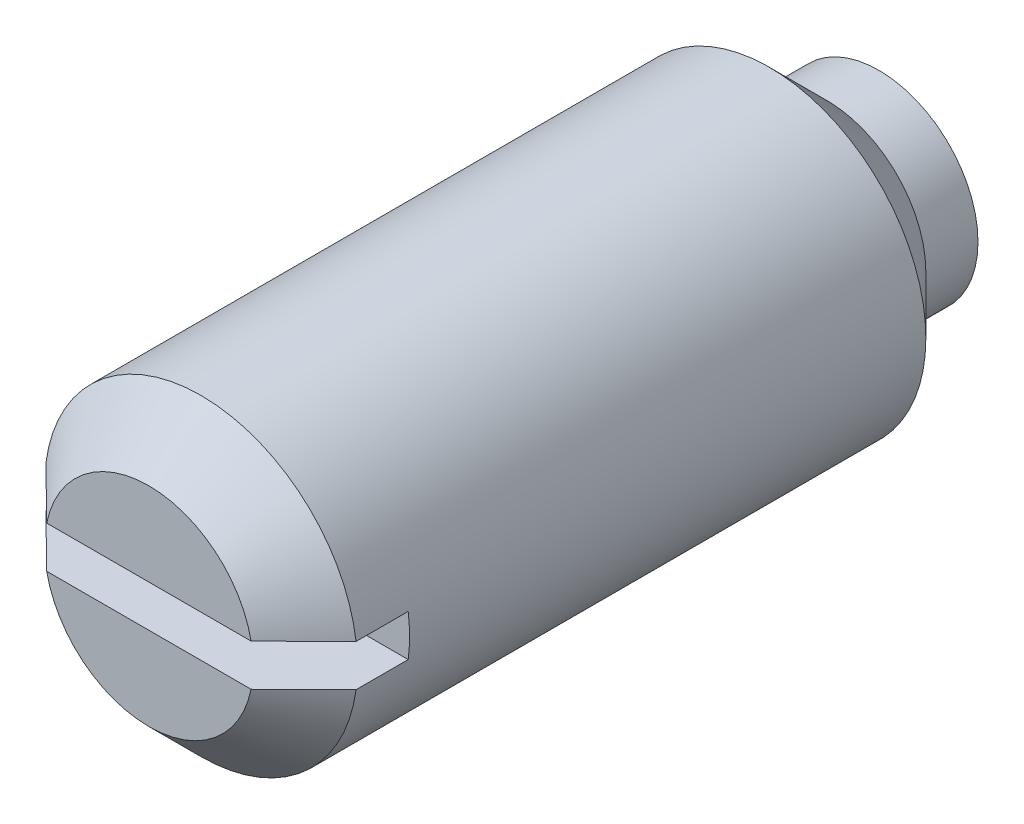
ISO-10303-21;
HEADER;
FILE_DESCRIPTION(('STEP AP214'),'2;1');
FILE_NAME('part.step','',(''),(''),'','','');
FILE_SCHEMA(('AUTOMOTIVE_DESIGN { 1 0 10303 214 1 1 1 1 }'));
ENDSEC;
DATA;
#1=APPLICATION_CONTEXT('core data for automotive mechanical design processes');
#2=APPLICATION_PROTOCOL_DEFINITION('international standard','automotive_design',2000,#1);
#3=PRODUCT_CONTEXT('',#1,'mechanical');
#4=PRODUCT('Part','Part','',(#3));
#5=PRODUCT_RELATED_PRODUCT_CATEGORY('part','',(#4));
#6=PRODUCT_DEFINITION_FORMATION('','',#4);
#7=PRODUCT_DEFINITION_CONTEXT('part definition',#1,'design');
#8=PRODUCT_DEFINITION('design','',#6,#7);
#9=PRODUCT_DEFINITION_SHAPE('','',#8);
#10=(LENGTH_UNIT() NAMED_UNIT(*) SI_UNIT(.MILLI.,.METRE.));
#11=(NAMED_UNIT(*) PLANE_ANGLE_UNIT() SI_UNIT($,.RADIAN.));
#12=(NAMED_UNIT(*) SI_UNIT($,.STERADIAN.) SOLID_ANGLE_UNIT());
#13=UNCERTAINTY_MEASURE_WITH_UNIT(LENGTH_MEASURE(1.E-05),#10,'distance_accuracy_value','');
#14=(GEOMETRIC_REPRESENTATION_CONTEXT(3) GLOBAL_UNCERTAINTY_ASSIGNED_CONTEXT((#13)) GLOBAL_UNIT_ASSIGNED_CONTEXT((#10,
#11,#12)) REPRESENTATION_CONTEXT('',''));
#15=CARTESIAN_POINT('',(0.,0.,0.));
#16=DIRECTION('',(0.,0.,1.));
#17=DIRECTION('',(1.,0.,0.));
#18=AXIS2_PLACEMENT_3D('',#15,#16,#17);
#19=CARTESIAN_POINT('',(0.,0.,-12.5));
#20=DIRECTION('',(0.,0.,-1.));
#21=DIRECTION('',(-1.,0.,0.));
#22=AXIS2_PLACEMENT_3D('',#19,#20,#21);
#23=CYLINDRICAL_SURFACE('',#22,1.5);
#24=DIRECTION('',(0.,0.,1.));
#25=VECTOR('',#24,1.);
#26=CARTESIAN_POINT('',(1.48660687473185,-0.2,6.5));
#27=LINE('',#26,#25);
#28=CARTESIAN_POINT('',(1.48660687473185,-0.2,6.5));
#29=VERTEX_POINT('',#28);
#30=CARTESIAN_POINT('',(1.48660687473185,-0.2,7.));
#31=VERTEX_POINT('',#30);
#32=EDGE_CURVE('E83',#29,#31,#27,.T.);
#33=ORIENTED_EDGE('',*,*,#32,.T.);
#34=CARTESIAN_POINT('',(0.,0.,7.));
#35=DIRECTION('',(0.,0.,1.));
#36=DIRECTION('',(1.,0.,0.));
#37=AXIS2_PLACEMENT_3D('',#34,#35,#36);
#38=CIRCLE('',#37,1.5);
#39=CARTESIAN_POINT('',(-1.48660687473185,-0.2,7.));
#40=VERTEX_POINT('',#39);
#41=EDGE_CURVE('E89',#31,#40,#38,.F.);
#42=ORIENTED_EDGE('',*,*,#41,.T.);
#43=DIRECTION('',(0.,0.,1.));
#44=VECTOR('',#43,1.);
#45=CARTESIAN_POINT('',(-1.48660687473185,-0.2,6.5));
#46=LINE('',#45,#44);
#47=CARTESIAN_POINT('',(-1.48660687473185,-0.2,6.5));
#48=VERTEX_POINT('',#47);
#49=EDGE_CURVE('E81',#48,#40,#46,.T.);
#50=ORIENTED_EDGE('',*,*,#49,.F.);
#51=CARTESIAN_POINT('',(0.,0.,6.5));
#52=DIRECTION('',(0.,0.,1.));
#53=DIRECTION('',(1.,0.,0.));
#54=AXIS2_PLACEMENT_3D('',#51,#52,#53);
#55=CIRCLE('',#54,1.5);
#56=CARTESIAN_POINT('',(-1.48660687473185,0.2,6.5));
#57=VERTEX_POINT('',#56);
#58=EDGE_CURVE('E65',#57,#48,#55,.T.);
#59=ORIENTED_EDGE('',*,*,#58,.F.);
#60=DIRECTION('',(0.,0.,1.));
#61=VECTOR('',#60,1.);
#62=CARTESIAN_POINT('',(-1.48660687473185,0.2,6.5));
#63=LINE('',#62,#61);
#64=CARTESIAN_POINT('',(-1.48660687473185,0.2,7.));
#65=VERTEX_POINT('',#64);
#66=EDGE_CURVE('E96',#57,#65,#63,.T.);
#67=ORIENTED_EDGE('',*,*,#66,.T.);
#68=CARTESIAN_POINT('',(0.,0.,7.));
#69=DIRECTION('',(0.,0.,1.));
#70=DIRECTION('',(1.,0.,0.));
#71=AXIS2_PLACEMENT_3D('',#68,#69,#70);
#72=CIRCLE('',#71,1.5);
#73=CARTESIAN_POINT('',(1.48660687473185,0.2,7.));
#74=VERTEX_POINT('',#73);
#75=EDGE_CURVE('E101',#65,#74,#72,.F.);
#76=ORIENTED_EDGE('',*,*,#75,.T.);
#77=DIRECTION('',(0.,0.,1.));
#78=VECTOR('',#77,1.);
#79=CARTESIAN_POINT('',(1.48660687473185,0.2,6.5));
#80=LINE('',#79,#78);
#81=CARTESIAN_POINT('',(1.48660687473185,0.2,6.5));
#82=VERTEX_POINT('',#81);
#83=EDGE_CURVE('E91',#82,#74,#80,.T.);
#84=ORIENTED_EDGE('',*,*,#83,.F.);
#85=EDGE_CURVE('E77',#29,#82,#55,.T.);
#86=ORIENTED_EDGE('',*,*,#85,.F.);
#87=EDGE_LOOP('',(#33,#42,#50,#59,#67,#76,#84,#86));
#88=FACE_BOUND('',#87,.T.);
#89=CARTESIAN_POINT('',(0.,0.,1.55));
#90=DIRECTION('',(0.,0.,1.));
#91=DIRECTION('',(1.,0.,0.));
#92=AXIS2_PLACEMENT_3D('',#89,#90,#91);
#93=CIRCLE('',#92,1.5);
#94=CARTESIAN_POINT('',(1.5,0.,1.55));
#95=VERTEX_POINT('',#94);
#96=EDGE_CURVE('E165',#95,#95,#93,.T.);
#97=ORIENTED_EDGE('',*,*,#96,.T.);
#98=EDGE_LOOP('',(#97));
#99=FACE_BOUND('',#98,.T.);
#100=ADVANCED_FACE('F14',(#88,#99),#23,.T.);
#101=CARTESIAN_POINT('',(0.,1.5,7.5));
#102=DIRECTION('',(0.,0.,1.));
#103=DIRECTION('',(1.,0.,0.));
#104=AXIS2_PLACEMENT_3D('',#101,#102,#103);
#105=PLANE('',#104);
#106=DIRECTION('',(1.,0.,0.));
#107=VECTOR('',#106,1.);
#108=CARTESIAN_POINT('',(-1.48660687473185,0.2,7.5));
#109=LINE('',#108,#107);
#110=CARTESIAN_POINT('',(-0.979795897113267,0.2,7.5));
#111=VERTEX_POINT('',#110);
#112=CARTESIAN_POINT('',(0.979795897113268,0.2,7.5));
#113=VERTEX_POINT('',#112);
#114=EDGE_CURVE('E75',#111,#113,#109,.T.);
#115=ORIENTED_EDGE('',*,*,#114,.T.);
#116=CARTESIAN_POINT('',(0.,0.,7.5));
#117=DIRECTION('',(0.,0.,1.));
#118=DIRECTION('',(1.,0.,0.));
#119=AXIS2_PLACEMENT_3D('',#116,#117,#118);
#120=CIRCLE('',#119,1.);
#121=EDGE_CURVE('E9',#113,#111,#120,.T.);
#122=ORIENTED_EDGE('',*,*,#121,.T.);
#123=EDGE_LOOP('',(#115,#122));
#124=FACE_BOUND('',#123,.T.);
#125=ADVANCED_FACE('F182',(#124),#105,.T.);
#126=DIRECTION('',(1.,0.,0.));
#127=VECTOR('',#126,1.);
#128=CARTESIAN_POINT('',(-1.48660687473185,-0.2,7.5));
#129=LINE('',#128,#127);
#130=CARTESIAN_POINT('',(-0.979795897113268,-0.2,7.5));
#131=VERTEX_POINT('',#130);
#132=CARTESIAN_POINT('',(0.979795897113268,-0.2,7.5));
#133=VERTEX_POINT('',#132);
#134=EDGE_CURVE('E152',#131,#133,#129,.T.);
#135=ORIENTED_EDGE('',*,*,#134,.F.);
#136=CARTESIAN_POINT('',(0.,0.,7.5));
#137=DIRECTION('',(0.,0.,1.));
#138=DIRECTION('',(1.,0.,0.));
#139=AXIS2_PLACEMENT_3D('',#136,#137,#138);
#140=CIRCLE('',#139,1.);
#141=EDGE_CURVE('E146',#131,#133,#140,.T.);
#142=ORIENTED_EDGE('',*,*,#141,.T.);
#143=EDGE_LOOP('',(#135,#142));
#144=FACE_BOUND('',#143,.T.);
#145=ADVANCED_FACE('F132',(#144),#105,.T.);
#146=CARTESIAN_POINT('',(-1.48660687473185,0.2,6.5));
#147=DIRECTION('',(0.,-1.,0.));
#148=DIRECTION('',(1.,0.,0.));
#149=AXIS2_PLACEMENT_3D('',#146,#147,#148);
#150=PLANE('',#149);
#151=ORIENTED_EDGE('',*,*,#83,.T.);
#152=CARTESIAN_POINT('',(1.48660687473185,0.2,7.));
#153=CARTESIAN_POINT('',(1.44446710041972,0.2,7.04176234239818));
#154=CARTESIAN_POINT('',(1.40231271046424,0.2,7.08350995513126));
#155=CARTESIAN_POINT('',(1.31796258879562,0.2,7.1669632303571));
#156=CARTESIAN_POINT('',(1.27576685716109,0.2,7.20866889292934));
#157=CARTESIAN_POINT('',(1.19132173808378,0.2,7.29202597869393));
#158=CARTESIAN_POINT('',(1.14907235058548,0.2,7.33367740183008));
#159=CARTESIAN_POINT('',(1.06449712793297,0.2,7.41690270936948));
#160=CARTESIAN_POINT('',(1.02217129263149,0.2,7.45847659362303));
#161=CARTESIAN_POINT('',(0.979795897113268,0.2,7.5));
#162=B_SPLINE_CURVE_WITH_KNOTS('',3,(#152,#153,#154,#155,#156,#157,#158,#159,#160,#161),
.UNSPECIFIED.,.F.,.F.,(4,2,2,2,4),(0.,0.177985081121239,0.355969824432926,0.533954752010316,
0.711940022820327),.UNSPECIFIED.);
#163=EDGE_CURVE('E23',#74,#113,#162,.T.);
#164=ORIENTED_EDGE('',*,*,#163,.T.);
#165=ORIENTED_EDGE('',*,*,#114,.F.);
#166=CARTESIAN_POINT('',(-0.979795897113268,0.2,7.5));
#167=CARTESIAN_POINT('',(-1.02217129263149,0.2,7.45847659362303));
#168=CARTESIAN_POINT('',(-1.06449712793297,0.2,7.41690270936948));
#169=CARTESIAN_POINT('',(-1.14907235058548,0.2,7.33367740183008));
#170=CARTESIAN_POINT('',(-1.19132173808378,0.2,7.29202597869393));
#171=CARTESIAN_POINT('',(-1.27576685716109,0.2,7.20866889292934));
#172=CARTESIAN_POINT('',(-1.31796258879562,0.2,7.1669632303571));
#173=CARTESIAN_POINT('',(-1.40231271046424,0.2,7.08350995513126));
#174=CARTESIAN_POINT('',(-1.44446710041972,0.2,7.04176234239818));
#175=CARTESIAN_POINT('',(-1.48660687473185,0.2,7.));
#176=B_SPLINE_CURVE_WITH_KNOTS('',3,(#166,#167,#168,#169,#170,#171,#172,#173,#174,#175),
.UNSPECIFIED.,.F.,.F.,(4,2,2,2,4),(0.,0.177985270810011,0.3559701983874,0.533954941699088,
0.711940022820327),.UNSPECIFIED.);
#177=EDGE_CURVE('E137',#111,#65,#176,.T.);
#178=ORIENTED_EDGE('',*,*,#177,.T.);
#179=ORIENTED_EDGE('',*,*,#66,.F.);
#180=DIRECTION('',(1.,0.,0.));
#181=VECTOR('',#180,1.);
#182=CARTESIAN_POINT('',(-1.48660687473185,0.2,6.5));
#183=LINE('',#182,#181);
#184=EDGE_CURVE('E71',#57,#82,#183,.T.);
#185=ORIENTED_EDGE('',*,*,#184,.T.);
#186=EDGE_LOOP('',(#151,#164,#165,#178,#179,#185));
#187=FACE_BOUND('',#186,.T.);
#188=ADVANCED_FACE('F125',(#187),#150,.T.);
#189=CARTESIAN_POINT('',(-1.48660687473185,-0.2,6.5));
#190=DIRECTION('',(0.,-1.,0.));
#191=DIRECTION('',(1.,0.,0.));
#192=AXIS2_PLACEMENT_3D('',#189,#190,#191);
#193=PLANE('',#192);
#194=ORIENTED_EDGE('',*,*,#49,.T.);
#195=CARTESIAN_POINT('',(-1.48660687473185,-0.2,7.));
#196=CARTESIAN_POINT('',(-1.44446710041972,-0.2,7.04176234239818));
#197=CARTESIAN_POINT('',(-1.40231271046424,-0.2,7.08350995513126));
#198=CARTESIAN_POINT('',(-1.31796258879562,-0.2,7.1669632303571));
#199=CARTESIAN_POINT('',(-1.27576685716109,-0.2,7.20866889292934));
#200=CARTESIAN_POINT('',(-1.19132173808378,-0.2,7.29202597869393));
#201=CARTESIAN_POINT('',(-1.14907235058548,-0.2,7.33367740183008));
#202=CARTESIAN_POINT('',(-1.06449712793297,-0.2,7.41690270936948));
#203=CARTESIAN_POINT('',(-1.02217129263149,-0.2,7.45847659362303));
#204=CARTESIAN_POINT('',(-0.979795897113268,-0.2,7.5));
#205=B_SPLINE_CURVE_WITH_KNOTS('',3,(#195,#196,#197,#198,#199,#200,#201,#202,#203,#204),
.UNSPECIFIED.,.F.,.F.,(4,2,2,2,4),(0.,0.177985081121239,0.355969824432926,0.533954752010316,
0.711940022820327),.UNSPECIFIED.);
#206=EDGE_CURVE('E112',#40,#131,#205,.T.);
#207=ORIENTED_EDGE('',*,*,#206,.T.);
#208=ORIENTED_EDGE('',*,*,#134,.T.);
#209=CARTESIAN_POINT('',(0.979795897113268,-0.2,7.5));
#210=CARTESIAN_POINT('',(1.02217129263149,-0.2,7.45847659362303));
#211=CARTESIAN_POINT('',(1.06449712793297,-0.2,7.41690270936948));
#212=CARTESIAN_POINT('',(1.14907235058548,-0.2,7.33367740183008));
#213=CARTESIAN_POINT('',(1.19132173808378,-0.2,7.29202597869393));
#214=CARTESIAN_POINT('',(1.27576685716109,-0.2,7.20866889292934));
#215=CARTESIAN_POINT('',(1.31796258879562,-0.2,7.1669632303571));
#216=CARTESIAN_POINT('',(1.40231271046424,-0.2,7.08350995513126));
#217=CARTESIAN_POINT('',(1.44446710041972,-0.2,7.04176234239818));
#218=CARTESIAN_POINT('',(1.48660687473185,-0.2,7.));
#219=B_SPLINE_CURVE_WITH_KNOTS('',3,(#209,#210,#211,#212,#213,#214,#215,#216,#217,#218),
.UNSPECIFIED.,.F.,.F.,(4,2,2,2,4),(0.,0.177985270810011,0.3559701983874,0.533954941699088,
0.711940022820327),.UNSPECIFIED.);
#220=EDGE_CURVE('E105',#133,#31,#219,.T.);
#221=ORIENTED_EDGE('',*,*,#220,.T.);
#222=ORIENTED_EDGE('',*,*,#32,.F.);
#223=DIRECTION('',(1.,0.,0.));
#224=VECTOR('',#223,1.);
#225=CARTESIAN_POINT('',(-1.48660687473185,-0.2,6.5));
#226=LINE('',#225,#224);
#227=EDGE_CURVE('E68',#48,#29,#226,.T.);
#228=ORIENTED_EDGE('',*,*,#227,.F.);
#229=EDGE_LOOP('',(#194,#207,#208,#221,#222,#228));
#230=FACE_BOUND('',#229,.T.);
#231=ADVANCED_FACE('F80',(#230),#193,.F.);
#232=CARTESIAN_POINT('',(0.,0.,6.5));
#233=DIRECTION('',(0.,0.,1.));
#234=DIRECTION('',(1.,0.,0.));
#235=AXIS2_PLACEMENT_3D('',#232,#233,#234);
#236=PLANE('',#235);
#237=ORIENTED_EDGE('',*,*,#58,.T.);
#238=ORIENTED_EDGE('',*,*,#227,.T.);
#239=ORIENTED_EDGE('',*,*,#85,.T.);
#240=ORIENTED_EDGE('',*,*,#184,.F.);
#241=EDGE_LOOP('',(#237,#238,#239,#240));
#242=FACE_BOUND('',#241,.T.);
#243=ADVANCED_FACE('F67',(#242),#236,.T.);
#244=CARTESIAN_POINT('',(0.,0.,8.81834183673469));
#245=DIRECTION('',(0.,0.,1.));
#246=DIRECTION('',(1.,0.,0.));
#247=AXIS2_PLACEMENT_3D('',#244,#245,#246);
#248=CYLINDRICAL_SURFACE('',#247,0.95);
#249=CARTESIAN_POINT('',(0.,0.,0.5));
#250=DIRECTION('',(0.,0.,1.));
#251=DIRECTION('',(1.,0.,0.));
#252=AXIS2_PLACEMENT_3D('',#249,#250,#251);
#253=CIRCLE('',#252,0.95);
#254=CARTESIAN_POINT('',(0.95,0.,0.5));
#255=VERTEX_POINT('',#254);
#256=EDGE_CURVE('E155',#255,#255,#253,.T.);
#257=ORIENTED_EDGE('',*,*,#256,.T.);
#258=EDGE_LOOP('',(#257));
#259=FACE_BOUND('',#258,.T.);
#260=CARTESIAN_POINT('',(0.,0.,1.));
#261=DIRECTION('',(0.,0.,1.));
#262=DIRECTION('',(1.,0.,0.));
#263=AXIS2_PLACEMENT_3D('',#260,#261,#262);
#264=CIRCLE('',#263,0.95);
#265=CARTESIAN_POINT('',(0.95,0.,1.));
#266=VERTEX_POINT('',#265);
#267=EDGE_CURVE('E162',#266,#266,#264,.T.);
#268=ORIENTED_EDGE('',*,*,#267,.F.);
#269=EDGE_LOOP('',(#268));
#270=FACE_BOUND('',#269,.T.);
#271=ADVANCED_FACE('F126',(#259,#270),#248,.T.);
#272=CARTESIAN_POINT('',(0.,0.,1.55));
#273=DIRECTION('',(0.,0.,1.));
#274=DIRECTION('',(1.,0.,0.));
#275=AXIS2_PLACEMENT_3D('',#272,#273,#274);
#276=CONICAL_SURFACE('',#275,1.5,0.785398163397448);
#277=ORIENTED_EDGE('',*,*,#267,.T.);
#278=EDGE_LOOP('',(#277));
#279=FACE_BOUND('',#278,.T.);
#280=ORIENTED_EDGE('',*,*,#96,.F.);
#281=EDGE_LOOP('',(#280));
#282=FACE_BOUND('',#281,.T.);
#283=ADVANCED_FACE('F169',(#279,#282),#276,.T.);
#284=CARTESIAN_POINT('',(0.,0.,0.75));
#285=DIRECTION('',(-1.,0.,0.));
#286=DIRECTION('',(0.,0.,1.));
#287=AXIS2_PLACEMENT_3D('',#284,#285,#286);
#288=SPHERICAL_SURFACE('',#287,0.75);
#289=CARTESIAN_POINT('',(0.,0.,0.75));
#290=DIRECTION('',(0.,0.,-1.));
#291=DIRECTION('',(-1.,0.,0.));
#292=AXIS2_PLACEMENT_3D('',#289,#290,#291);
#293=SPHERICAL_SURFACE('',#292,0.75);
#294=CARTESIAN_POINT('',(0.,0.,0.5));
#295=DIRECTION('',(0.,0.,-1.));
#296=DIRECTION('',(-1.,0.,0.));
#297=AXIS2_PLACEMENT_3D('',#294,#295,#296);
#298=CIRCLE('',#297,0.707106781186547);
#299=CARTESIAN_POINT('',(-0.707106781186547,0.,0.5));
#300=VERTEX_POINT('',#299);
#301=EDGE_CURVE('E98',#300,#300,#298,.T.);
#302=ORIENTED_EDGE('',*,*,#301,.T.);
#303=EDGE_LOOP('',(#302));
#304=FACE_BOUND('',#303,.T.);
#305=ADVANCED_FACE('F171',(#304),#293,.T.);
#306=CARTESIAN_POINT('',(0.,0.707106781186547,0.5));
#307=DIRECTION('',(0.,0.,-1.));
#308=DIRECTION('',(-1.,0.,0.));
#309=AXIS2_PLACEMENT_3D('',#306,#307,#308);
#310=PLANE('',#309);
#311=ORIENTED_EDGE('',*,*,#301,.F.);
#312=EDGE_LOOP('',(#311));
#313=FACE_BOUND('',#312,.T.);
#314=ORIENTED_EDGE('',*,*,#256,.F.);
#315=EDGE_LOOP('',(#314));
#316=FACE_BOUND('',#315,.T.);
#317=ADVANCED_FACE('F133',(#313,#316),#310,.T.);
#318=CARTESIAN_POINT('',(0.,0.,7.));
#319=DIRECTION('',(0.,0.,-1.));
#320=DIRECTION('',(-1.,0.,0.));
#321=AXIS2_PLACEMENT_3D('',#318,#319,#320);
#322=CONICAL_SURFACE('',#321,1.5,0.785398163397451);
#323=ORIENTED_EDGE('',*,*,#220,.F.);
#324=ORIENTED_EDGE('',*,*,#141,.F.);
#325=ORIENTED_EDGE('',*,*,#206,.F.);
#326=ORIENTED_EDGE('',*,*,#41,.F.);
#327=EDGE_LOOP('',(#323,#324,#325,#326));
#328=FACE_BOUND('',#327,.T.);
#329=ADVANCED_FACE('F118',(#328),#322,.T.);
#330=CARTESIAN_POINT('',(0.,0.,7.));
#331=DIRECTION('',(0.,0.,-1.));
#332=DIRECTION('',(-1.,0.,0.));
#333=AXIS2_PLACEMENT_3D('',#330,#331,#332);
#334=CONICAL_SURFACE('',#333,1.5,0.785398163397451);
#335=ORIENTED_EDGE('',*,*,#177,.F.);
#336=ORIENTED_EDGE('',*,*,#121,.F.);
#337=ORIENTED_EDGE('',*,*,#163,.F.);
#338=ORIENTED_EDGE('',*,*,#75,.F.);
#339=EDGE_LOOP('',(#335,#336,#337,#338));
#340=FACE_BOUND('',#339,.T.);
#341=ADVANCED_FACE('F16',(#340),#334,.T.);
#342=CLOSED_SHELL('',(#100,#125,#145,#188,#231,#243,#271,#283,#305,#317,#329,#341));
#343=MANIFOLD_SOLID_BREP('B1',#342);
#344=ADVANCED_BREP_SHAPE_REPRESENTATION('',(#18,#343),#14);
#345=SHAPE_DEFINITION_REPRESENTATION(#9,#344);
ENDSEC;
END-ISO-10303-21;
